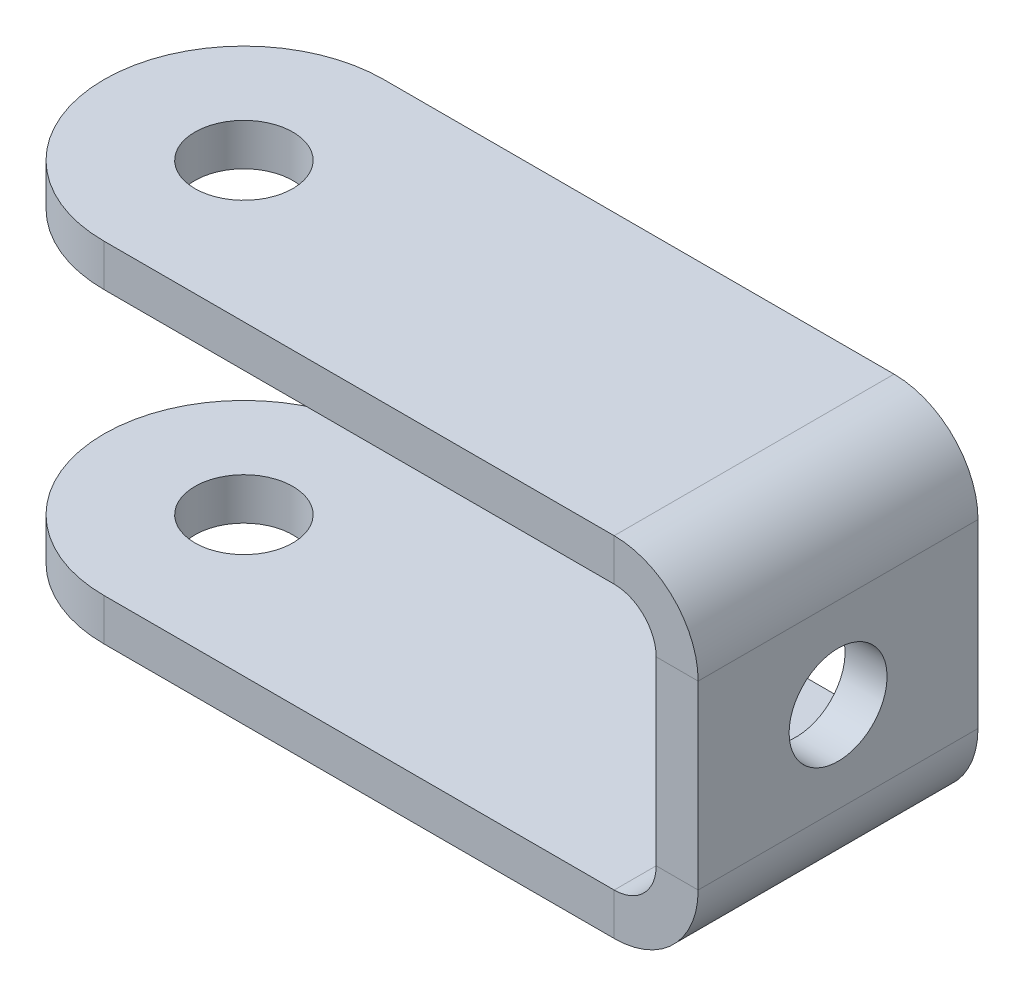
ISO-10303-21;
HEADER;
FILE_DESCRIPTION(('STEP AP214'),'2;1');
FILE_NAME('part.step','',(''),(''),'','','');
FILE_SCHEMA(('AUTOMOTIVE_DESIGN { 1 0 10303 214 1 1 1 1 }'));
ENDSEC;
DATA;
#1=APPLICATION_CONTEXT('core data for automotive mechanical design processes');
#2=APPLICATION_PROTOCOL_DEFINITION('international standard','automotive_design',2000,#1);
#3=PRODUCT_CONTEXT('',#1,'mechanical');
#4=PRODUCT('Part','Part','',(#3));
#5=PRODUCT_RELATED_PRODUCT_CATEGORY('part','',(#4));
#6=PRODUCT_DEFINITION_FORMATION('','',#4);
#7=PRODUCT_DEFINITION_CONTEXT('part definition',#1,'design');
#8=PRODUCT_DEFINITION('design','',#6,#7);
#9=PRODUCT_DEFINITION_SHAPE('','',#8);
#10=(LENGTH_UNIT() NAMED_UNIT(*) SI_UNIT(.MILLI.,.METRE.));
#11=(NAMED_UNIT(*) PLANE_ANGLE_UNIT() SI_UNIT($,.RADIAN.));
#12=(NAMED_UNIT(*) SI_UNIT($,.STERADIAN.) SOLID_ANGLE_UNIT());
#13=UNCERTAINTY_MEASURE_WITH_UNIT(LENGTH_MEASURE(1.E-05),#10,'distance_accuracy_value','');
#14=(GEOMETRIC_REPRESENTATION_CONTEXT(3) GLOBAL_UNCERTAINTY_ASSIGNED_CONTEXT((#13)) GLOBAL_UNIT_ASSIGNED_CONTEXT((#10,
#11,#12)) REPRESENTATION_CONTEXT('',''));
#15=CARTESIAN_POINT('',(0.,0.,0.));
#16=DIRECTION('',(0.,0.,1.));
#17=DIRECTION('',(1.,0.,0.));
#18=AXIS2_PLACEMENT_3D('',#15,#16,#17);
#19=CARTESIAN_POINT('',(19.7328541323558,-18.7671458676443,-5.));
#20=DIRECTION('',(-1.,0.,0.));
#21=DIRECTION('',(0.,0.,1.));
#22=AXIS2_PLACEMENT_3D('',#19,#20,#21);
#23=PLANE('',#22);
#24=CARTESIAN_POINT('',(19.7328541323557,6.23285413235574,-5.));
#25=DIRECTION('',(-1.,0.,0.));
#26=DIRECTION('',(0.,0.,1.));
#27=AXIS2_PLACEMENT_3D('',#24,#25,#26);
#28=CIRCLE('',#27,1.75);
#29=CARTESIAN_POINT('',(19.7328541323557,6.23285413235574,-3.25));
#30=VERTEX_POINT('',#29);
#31=EDGE_CURVE('E172',#30,#30,#28,.T.);
#32=ORIENTED_EDGE('',*,*,#31,.F.);
#33=EDGE_LOOP('',(#32));
#34=FACE_BOUND('',#33,.T.);
#35=DIRECTION('',(0.,-1.,0.));
#36=VECTOR('',#35,1.);
#37=CARTESIAN_POINT('',(19.7328541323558,-18.7671458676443,-10.));
#38=LINE('',#37,#36);
#39=CARTESIAN_POINT('',(19.7328541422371,9.46570826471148,-10.));
#40=VERTEX_POINT('',#39);
#41=CARTESIAN_POINT('',(19.7328541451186,3.00000000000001,-10.));
#42=VERTEX_POINT('',#41);
#43=EDGE_CURVE('E44',#40,#42,#38,.T.);
#44=ORIENTED_EDGE('',*,*,#43,.T.);
#45=DIRECTION('',(0.,0.,1.));
#46=VECTOR('',#45,1.);
#47=CARTESIAN_POINT('',(19.7328541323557,3.00000000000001,-5.));
#48=LINE('',#47,#46);
#49=CARTESIAN_POINT('',(19.7328541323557,3.00000000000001,0.));
#50=VERTEX_POINT('',#49);
#51=EDGE_CURVE('E142',#42,#50,#48,.T.);
#52=ORIENTED_EDGE('',*,*,#51,.T.);
#53=DIRECTION('',(0.,1.,0.));
#54=VECTOR('',#53,1.);
#55=CARTESIAN_POINT('',(19.7328541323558,-18.7671458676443,0.));
#56=LINE('',#55,#54);
#57=CARTESIAN_POINT('',(19.7328541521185,9.46570826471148,0.));
#58=VERTEX_POINT('',#57);
#59=EDGE_CURVE('E161',#50,#58,#56,.T.);
#60=ORIENTED_EDGE('',*,*,#59,.T.);
#61=DIRECTION('',(0.,0.,1.));
#62=VECTOR('',#61,1.);
#63=CARTESIAN_POINT('',(19.7328541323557,9.46570826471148,-5.));
#64=LINE('',#63,#62);
#65=EDGE_CURVE('E179',#40,#58,#64,.T.);
#66=ORIENTED_EDGE('',*,*,#65,.F.);
#67=EDGE_LOOP('',(#44,#52,#60,#66));
#68=FACE_BOUND('',#67,.T.);
#69=ADVANCED_FACE('F40',(#34,#68),#23,.T.);
#70=CARTESIAN_POINT('',(19.7328541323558,-18.7671458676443,-10.));
#71=DIRECTION('',(0.,0.,1.));
#72=DIRECTION('',(0.,1.,0.));
#73=AXIS2_PLACEMENT_3D('',#70,#71,#72);
#74=PLANE('',#73);
#75=DIRECTION('',(1.,0.,0.));
#76=VECTOR('',#75,1.);
#77=CARTESIAN_POINT('',(19.7328541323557,3.00000000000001,-10.));
#78=LINE('',#77,#76);
#79=CARTESIAN_POINT('',(21.2328541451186,3.00000000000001,-10.));
#80=VERTEX_POINT('',#79);
#81=EDGE_CURVE('E131',#42,#80,#78,.T.);
#82=ORIENTED_EDGE('',*,*,#81,.F.);
#83=ORIENTED_EDGE('',*,*,#43,.F.);
#84=DIRECTION('',(1.,0.,0.));
#85=VECTOR('',#84,1.);
#86=CARTESIAN_POINT('',(19.7328541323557,9.46570826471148,-10.));
#87=LINE('',#86,#85);
#88=CARTESIAN_POINT('',(21.2328541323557,9.46570826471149,-10.));
#89=VERTEX_POINT('',#88);
#90=EDGE_CURVE('E158',#40,#89,#87,.T.);
#91=ORIENTED_EDGE('',*,*,#90,.T.);
#92=DIRECTION('',(0.,-1.,0.));
#93=VECTOR('',#92,1.);
#94=CARTESIAN_POINT('',(21.2328541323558,-18.7671458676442,-10.));
#95=LINE('',#94,#93);
#96=EDGE_CURVE('E156',#89,#80,#95,.T.);
#97=ORIENTED_EDGE('',*,*,#96,.T.);
#98=EDGE_LOOP('',(#82,#83,#91,#97));
#99=FACE_BOUND('',#98,.T.);
#100=ADVANCED_FACE('F157',(#99),#74,.F.);
#101=CARTESIAN_POINT('',(19.7328541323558,-18.7671458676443,0.));
#102=DIRECTION('',(0.,0.,-1.));
#103=DIRECTION('',(0.,-1.,0.));
#104=AXIS2_PLACEMENT_3D('',#101,#102,#103);
#105=PLANE('',#104);
#106=DIRECTION('',(-1.,0.,0.));
#107=VECTOR('',#106,1.);
#108=CARTESIAN_POINT('',(19.7328541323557,3.00000000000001,0.));
#109=LINE('',#108,#107);
#110=CARTESIAN_POINT('',(21.2328541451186,3.00000000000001,0.));
#111=VERTEX_POINT('',#110);
#112=EDGE_CURVE('E12',#111,#50,#109,.T.);
#113=ORIENTED_EDGE('',*,*,#112,.F.);
#114=DIRECTION('',(0.,1.,0.));
#115=VECTOR('',#114,1.);
#116=CARTESIAN_POINT('',(21.2328541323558,-18.7671458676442,0.));
#117=LINE('',#116,#115);
#118=CARTESIAN_POINT('',(21.2328541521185,9.46570826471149,0.));
#119=VERTEX_POINT('',#118);
#120=EDGE_CURVE('E162',#111,#119,#117,.T.);
#121=ORIENTED_EDGE('',*,*,#120,.T.);
#122=DIRECTION('',(-1.,0.,0.));
#123=VECTOR('',#122,1.);
#124=CARTESIAN_POINT('',(19.7328541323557,9.46570826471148,0.));
#125=LINE('',#124,#123);
#126=EDGE_CURVE('E180',#119,#58,#125,.T.);
#127=ORIENTED_EDGE('',*,*,#126,.T.);
#128=ORIENTED_EDGE('',*,*,#59,.F.);
#129=EDGE_LOOP('',(#113,#121,#127,#128));
#130=FACE_BOUND('',#129,.T.);
#131=ADVANCED_FACE('F42',(#130),#105,.F.);
#132=CARTESIAN_POINT('',(21.2328541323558,-18.7671458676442,-5.));
#133=DIRECTION('',(-1.,0.,0.));
#134=DIRECTION('',(0.,0.,1.));
#135=AXIS2_PLACEMENT_3D('',#132,#133,#134);
#136=PLANE('',#135);
#137=DIRECTION('',(0.,0.,1.));
#138=VECTOR('',#137,1.);
#139=CARTESIAN_POINT('',(21.2328541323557,3.00000000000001,-5.));
#140=LINE('',#139,#138);
#141=EDGE_CURVE('E49',#80,#111,#140,.T.);
#142=ORIENTED_EDGE('',*,*,#141,.F.);
#143=ORIENTED_EDGE('',*,*,#96,.F.);
#144=DIRECTION('',(0.,0.,1.));
#145=VECTOR('',#144,1.);
#146=CARTESIAN_POINT('',(21.2328541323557,9.46570826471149,-5.));
#147=LINE('',#146,#145);
#148=EDGE_CURVE('E186',#89,#119,#147,.T.);
#149=ORIENTED_EDGE('',*,*,#148,.T.);
#150=ORIENTED_EDGE('',*,*,#120,.F.);
#151=EDGE_LOOP('',(#142,#143,#149,#150));
#152=FACE_BOUND('',#151,.T.);
#153=CARTESIAN_POINT('',(21.2328541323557,6.23285413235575,-5.));
#154=DIRECTION('',(-1.,0.,0.));
#155=DIRECTION('',(0.,0.,1.));
#156=AXIS2_PLACEMENT_3D('',#153,#154,#155);
#157=CIRCLE('',#156,1.75);
#158=CARTESIAN_POINT('',(21.2328541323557,6.23285413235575,-3.25));
#159=VERTEX_POINT('',#158);
#160=EDGE_CURVE('E212',#159,#159,#157,.T.);
#161=ORIENTED_EDGE('',*,*,#160,.T.);
#162=EDGE_LOOP('',(#161));
#163=FACE_BOUND('',#162,.T.);
#164=ADVANCED_FACE('F165',(#152,#163),#136,.F.);
#165=CARTESIAN_POINT('',(19.7328541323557,6.23285413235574,-5.));
#166=DIRECTION('',(1.,0.,0.));
#167=DIRECTION('',(0.,0.,-1.));
#168=AXIS2_PLACEMENT_3D('',#165,#166,#167);
#169=CYLINDRICAL_SURFACE('',#168,1.75);
#170=ORIENTED_EDGE('',*,*,#31,.T.);
#171=EDGE_LOOP('',(#170));
#172=FACE_BOUND('',#171,.T.);
#173=ORIENTED_EDGE('',*,*,#160,.F.);
#174=EDGE_LOOP('',(#173));
#175=FACE_BOUND('',#174,.T.);
#176=ADVANCED_FACE('F218',(#172,#175),#169,.F.);
#177=CARTESIAN_POINT('',(18.2328541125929,9.46570826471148,-10.));
#178=DIRECTION('',(0.,0.,1.));
#179=DIRECTION('',(0.,1.,0.));
#180=AXIS2_PLACEMENT_3D('',#177,#178,#179);
#181=PLANE('',#180);
#182=DIRECTION('',(0.,1.,0.));
#183=VECTOR('',#182,1.);
#184=CARTESIAN_POINT('',(18.2328541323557,10.9657082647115,-10.));
#185=LINE('',#184,#183);
#186=CARTESIAN_POINT('',(18.2328541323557,10.9657082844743,-10.));
#187=VERTEX_POINT('',#186);
#188=CARTESIAN_POINT('',(18.2328541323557,12.4657082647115,-10.));
#189=VERTEX_POINT('',#188);
#190=EDGE_CURVE('E536',#187,#189,#185,.T.);
#191=ORIENTED_EDGE('',*,*,#190,.T.);
#192=CARTESIAN_POINT('',(18.2328541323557,9.46570826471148,-10.));
#193=DIRECTION('',(0.,0.,-1.));
#194=DIRECTION('',(0.,-1.,0.));
#195=AXIS2_PLACEMENT_3D('',#192,#193,#194);
#196=CIRCLE('',#195,3.0000000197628);
#197=EDGE_CURVE('E57',#189,#89,#196,.T.);
#198=ORIENTED_EDGE('',*,*,#197,.T.);
#199=ORIENTED_EDGE('',*,*,#90,.F.);
#200=CARTESIAN_POINT('',(18.2328541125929,9.46570826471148,-10.));
#201=DIRECTION('',(0.,0.,-1.));
#202=DIRECTION('',(0.,-1.,0.));
#203=AXIS2_PLACEMENT_3D('',#200,#201,#202);
#204=CIRCLE('',#203,1.5000000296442);
#205=EDGE_CURVE('E205',#187,#40,#204,.T.);
#206=ORIENTED_EDGE('',*,*,#205,.F.);
#207=EDGE_LOOP('',(#191,#198,#199,#206));
#208=FACE_BOUND('',#207,.T.);
#209=ADVANCED_FACE('F234',(#208),#181,.F.);
#210=CARTESIAN_POINT('',(18.2328541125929,9.46570826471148,0.));
#211=DIRECTION('',(0.,0.,-1.));
#212=DIRECTION('',(0.,-1.,0.));
#213=AXIS2_PLACEMENT_3D('',#210,#211,#212);
#214=PLANE('',#213);
#215=CARTESIAN_POINT('',(18.2328541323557,9.46570826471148,0.));
#216=DIRECTION('',(0.,0.,-1.));
#217=DIRECTION('',(0.,-1.,0.));
#218=AXIS2_PLACEMENT_3D('',#215,#216,#217);
#219=CIRCLE('',#218,3.0000000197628);
#220=CARTESIAN_POINT('',(18.2328541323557,12.4657082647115,0.));
#221=VERTEX_POINT('',#220);
#222=EDGE_CURVE('E198',#119,#221,#219,.F.);
#223=ORIENTED_EDGE('',*,*,#222,.T.);
#224=DIRECTION('',(0.,-1.,0.));
#225=VECTOR('',#224,1.);
#226=CARTESIAN_POINT('',(18.2328541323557,10.9657082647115,0.));
#227=LINE('',#226,#225);
#228=CARTESIAN_POINT('',(18.2328541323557,10.9657082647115,0.));
#229=VERTEX_POINT('',#228);
#230=EDGE_CURVE('E508',#221,#229,#227,.T.);
#231=ORIENTED_EDGE('',*,*,#230,.T.);
#232=CARTESIAN_POINT('',(18.2328541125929,9.46570826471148,0.));
#233=DIRECTION('',(0.,0.,1.));
#234=DIRECTION('',(0.,1.,0.));
#235=AXIS2_PLACEMENT_3D('',#232,#233,#234);
#236=CIRCLE('',#235,1.5000000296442);
#237=EDGE_CURVE('E199',#58,#229,#236,.T.);
#238=ORIENTED_EDGE('',*,*,#237,.F.);
#239=ORIENTED_EDGE('',*,*,#126,.F.);
#240=EDGE_LOOP('',(#223,#231,#238,#239));
#241=FACE_BOUND('',#240,.T.);
#242=ADVANCED_FACE('F196',(#241),#214,.F.);
#243=CARTESIAN_POINT('',(18.2328541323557,9.46570826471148,5.71173272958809));
#244=DIRECTION('',(0.,0.,-1.));
#245=DIRECTION('',(0.,-1.,0.));
#246=AXIS2_PLACEMENT_3D('',#243,#244,#245);
#247=CYLINDRICAL_SURFACE('',#246,1.5000000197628);
#248=ORIENTED_EDGE('',*,*,#65,.T.);
#249=ORIENTED_EDGE('',*,*,#237,.T.);
#250=DIRECTION('',(0.,0.,1.));
#251=VECTOR('',#250,1.);
#252=CARTESIAN_POINT('',(18.2328541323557,10.9657082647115,-5.));
#253=LINE('',#252,#251);
#254=EDGE_CURVE('E528',#187,#229,#253,.T.);
#255=ORIENTED_EDGE('',*,*,#254,.F.);
#256=ORIENTED_EDGE('',*,*,#205,.T.);
#257=EDGE_LOOP('',(#248,#249,#255,#256));
#258=FACE_BOUND('',#257,.T.);
#259=ADVANCED_FACE('F274',(#258),#247,.F.);
#260=CARTESIAN_POINT('',(18.2328541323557,9.46570826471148,5.71173272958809));
#261=DIRECTION('',(0.,0.,-1.));
#262=DIRECTION('',(0.,-1.,0.));
#263=AXIS2_PLACEMENT_3D('',#260,#261,#262);
#264=CYLINDRICAL_SURFACE('',#263,3.0000000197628);
#265=ORIENTED_EDGE('',*,*,#148,.F.);
#266=ORIENTED_EDGE('',*,*,#197,.F.);
#267=DIRECTION('',(0.,0.,1.));
#268=VECTOR('',#267,1.);
#269=CARTESIAN_POINT('',(18.2328541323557,12.4657082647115,-5.));
#270=LINE('',#269,#268);
#271=EDGE_CURVE('E204',#189,#221,#270,.T.);
#272=ORIENTED_EDGE('',*,*,#271,.T.);
#273=ORIENTED_EDGE('',*,*,#222,.F.);
#274=EDGE_LOOP('',(#265,#266,#272,#273));
#275=FACE_BOUND('',#274,.T.);
#276=ADVANCED_FACE('F202',(#275),#264,.T.);
#277=CARTESIAN_POINT('',(0.,10.9657082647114,-5.));
#278=DIRECTION('',(0.,1.,0.));
#279=DIRECTION('',(0.,0.,-1.));
#280=AXIS2_PLACEMENT_3D('',#277,#278,#279);
#281=CYLINDRICAL_SURFACE('',#280,5.);
#282=CARTESIAN_POINT('',(0.,12.4657082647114,-5.));
#283=DIRECTION('',(0.,-1.,0.));
#284=DIRECTION('',(0.,0.,1.));
#285=AXIS2_PLACEMENT_3D('',#282,#283,#284);
#286=CIRCLE('',#285,5.);
#287=CARTESIAN_POINT('',(0.,12.4657082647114,0.));
#288=VERTEX_POINT('',#287);
#289=CARTESIAN_POINT('',(0.,12.4657082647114,-10.));
#290=VERTEX_POINT('',#289);
#291=EDGE_CURVE('E500',#288,#290,#286,.T.);
#292=ORIENTED_EDGE('',*,*,#291,.T.);
#293=DIRECTION('',(0.,1.,0.));
#294=VECTOR('',#293,1.);
#295=CARTESIAN_POINT('',(0.,10.9657082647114,-10.));
#296=LINE('',#295,#294);
#297=CARTESIAN_POINT('',(0.,10.9657082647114,-10.));
#298=VERTEX_POINT('',#297);
#299=EDGE_CURVE('E503',#298,#290,#296,.T.);
#300=ORIENTED_EDGE('',*,*,#299,.F.);
#301=CARTESIAN_POINT('',(0.,10.9657082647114,-5.));
#302=DIRECTION('',(0.,-1.,0.));
#303=DIRECTION('',(0.,0.,1.));
#304=AXIS2_PLACEMENT_3D('',#301,#302,#303);
#305=CIRCLE('',#304,5.);
#306=CARTESIAN_POINT('',(0.,10.9657082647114,0.));
#307=VERTEX_POINT('',#306);
#308=EDGE_CURVE('E524',#307,#298,#305,.T.);
#309=ORIENTED_EDGE('',*,*,#308,.F.);
#310=DIRECTION('',(0.,1.,0.));
#311=VECTOR('',#310,1.);
#312=CARTESIAN_POINT('',(0.,10.9657082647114,0.));
#313=LINE('',#312,#311);
#314=EDGE_CURVE('E506',#307,#288,#313,.T.);
#315=ORIENTED_EDGE('',*,*,#314,.T.);
#316=EDGE_LOOP('',(#292,#300,#309,#315));
#317=FACE_BOUND('',#316,.T.);
#318=ADVANCED_FACE('F300',(#317),#281,.T.);
#319=CARTESIAN_POINT('',(0.,10.9657082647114,-5.));
#320=DIRECTION('',(0.,1.,0.));
#321=DIRECTION('',(0.,0.,-1.));
#322=AXIS2_PLACEMENT_3D('',#319,#320,#321);
#323=CYLINDRICAL_SURFACE('',#322,1.75);
#324=CARTESIAN_POINT('',(0.,10.9657082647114,-5.));
#325=DIRECTION('',(0.,-1.,0.));
#326=DIRECTION('',(0.,0.,1.));
#327=AXIS2_PLACEMENT_3D('',#324,#325,#326);
#328=CIRCLE('',#327,1.75);
#329=CARTESIAN_POINT('',(0.,10.9657082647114,-3.25));
#330=VERTEX_POINT('',#329);
#331=EDGE_CURVE('E531',#330,#330,#328,.T.);
#332=ORIENTED_EDGE('',*,*,#331,.T.);
#333=EDGE_LOOP('',(#332));
#334=FACE_BOUND('',#333,.T.);
#335=CARTESIAN_POINT('',(0.,12.4657082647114,-5.));
#336=DIRECTION('',(0.,-1.,0.));
#337=DIRECTION('',(0.,0.,1.));
#338=AXIS2_PLACEMENT_3D('',#335,#336,#337);
#339=CIRCLE('',#338,1.75);
#340=CARTESIAN_POINT('',(0.,12.4657082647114,-3.25));
#341=VERTEX_POINT('',#340);
#342=EDGE_CURVE('E512',#341,#341,#339,.T.);
#343=ORIENTED_EDGE('',*,*,#342,.F.);
#344=EDGE_LOOP('',(#343));
#345=FACE_BOUND('',#344,.T.);
#346=ADVANCED_FACE('F314',(#334,#345),#323,.F.);
#347=CARTESIAN_POINT('',(50.,10.9657082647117,-5.));
#348=DIRECTION('',(0.,-1.,0.));
#349=DIRECTION('',(0.,0.,1.));
#350=AXIS2_PLACEMENT_3D('',#347,#348,#349);
#351=PLANE('',#350);
#352=ORIENTED_EDGE('',*,*,#331,.F.);
#353=EDGE_LOOP('',(#352));
#354=FACE_BOUND('',#353,.T.);
#355=DIRECTION('',(1.,0.,0.));
#356=VECTOR('',#355,1.);
#357=CARTESIAN_POINT('',(50.,10.9657082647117,-10.));
#358=LINE('',#357,#356);
#359=EDGE_CURVE('E511',#298,#187,#358,.T.);
#360=ORIENTED_EDGE('',*,*,#359,.T.);
#361=ORIENTED_EDGE('',*,*,#254,.T.);
#362=DIRECTION('',(-1.,0.,0.));
#363=VECTOR('',#362,1.);
#364=CARTESIAN_POINT('',(50.,10.9657082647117,0.));
#365=LINE('',#364,#363);
#366=EDGE_CURVE('E526',#229,#307,#365,.T.);
#367=ORIENTED_EDGE('',*,*,#366,.T.);
#368=ORIENTED_EDGE('',*,*,#308,.T.);
#369=EDGE_LOOP('',(#360,#361,#367,#368));
#370=FACE_BOUND('',#369,.T.);
#371=ADVANCED_FACE('F306',(#354,#370),#351,.T.);
#372=CARTESIAN_POINT('',(50.,10.9657082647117,0.));
#373=DIRECTION('',(0.,0.,-1.));
#374=DIRECTION('',(1.,0.,0.));
#375=AXIS2_PLACEMENT_3D('',#372,#373,#374);
#376=PLANE('',#375);
#377=ORIENTED_EDGE('',*,*,#230,.F.);
#378=DIRECTION('',(-1.,0.,0.));
#379=VECTOR('',#378,1.);
#380=CARTESIAN_POINT('',(50.,12.4657082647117,0.));
#381=LINE('',#380,#379);
#382=EDGE_CURVE('E522',#221,#288,#381,.T.);
#383=ORIENTED_EDGE('',*,*,#382,.T.);
#384=ORIENTED_EDGE('',*,*,#314,.F.);
#385=ORIENTED_EDGE('',*,*,#366,.F.);
#386=EDGE_LOOP('',(#377,#383,#384,#385));
#387=FACE_BOUND('',#386,.T.);
#388=ADVANCED_FACE('F313',(#387),#376,.F.);
#389=CARTESIAN_POINT('',(50.,12.4657082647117,-5.));
#390=DIRECTION('',(0.,-1.,0.));
#391=DIRECTION('',(0.,0.,1.));
#392=AXIS2_PLACEMENT_3D('',#389,#390,#391);
#393=PLANE('',#392);
#394=ORIENTED_EDGE('',*,*,#271,.F.);
#395=DIRECTION('',(1.,0.,0.));
#396=VECTOR('',#395,1.);
#397=CARTESIAN_POINT('',(50.,12.4657082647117,-10.));
#398=LINE('',#397,#396);
#399=EDGE_CURVE('E208',#290,#189,#398,.T.);
#400=ORIENTED_EDGE('',*,*,#399,.F.);
#401=ORIENTED_EDGE('',*,*,#291,.F.);
#402=ORIENTED_EDGE('',*,*,#382,.F.);
#403=EDGE_LOOP('',(#394,#400,#401,#402));
#404=FACE_BOUND('',#403,.T.);
#405=ORIENTED_EDGE('',*,*,#342,.T.);
#406=EDGE_LOOP('',(#405));
#407=FACE_BOUND('',#406,.T.);
#408=ADVANCED_FACE('F323',(#404,#407),#393,.F.);
#409=CARTESIAN_POINT('',(50.,10.9657082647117,-10.));
#410=DIRECTION('',(0.,0.,1.));
#411=DIRECTION('',(-1.,0.,0.));
#412=AXIS2_PLACEMENT_3D('',#409,#410,#411);
#413=PLANE('',#412);
#414=ORIENTED_EDGE('',*,*,#190,.F.);
#415=ORIENTED_EDGE('',*,*,#359,.F.);
#416=ORIENTED_EDGE('',*,*,#299,.T.);
#417=ORIENTED_EDGE('',*,*,#399,.T.);
#418=EDGE_LOOP('',(#414,#415,#416,#417));
#419=FACE_BOUND('',#418,.T.);
#420=ADVANCED_FACE('F330',(#419),#413,.F.);
#421=CARTESIAN_POINT('',(0.,1.5,-5.));
#422=DIRECTION('',(0.,-1.,0.));
#423=DIRECTION('',(0.,0.,-1.));
#424=AXIS2_PLACEMENT_3D('',#421,#422,#423);
#425=CYLINDRICAL_SURFACE('',#424,1.75);
#426=CARTESIAN_POINT('',(0.,1.5,-5.));
#427=DIRECTION('',(0.,1.,0.));
#428=DIRECTION('',(0.,0.,1.));
#429=AXIS2_PLACEMENT_3D('',#426,#427,#428);
#430=CIRCLE('',#429,1.75);
#431=CARTESIAN_POINT('',(0.,1.5,-3.25));
#432=VERTEX_POINT('',#431);
#433=EDGE_CURVE('E573',#432,#432,#430,.T.);
#434=ORIENTED_EDGE('',*,*,#433,.T.);
#435=EDGE_LOOP('',(#434));
#436=FACE_BOUND('',#435,.T.);
#437=CARTESIAN_POINT('',(0.,0.,-5.));
#438=DIRECTION('',(0.,1.,0.));
#439=DIRECTION('',(0.,0.,1.));
#440=AXIS2_PLACEMENT_3D('',#437,#438,#439);
#441=CIRCLE('',#440,1.75);
#442=CARTESIAN_POINT('',(0.,0.,-3.25));
#443=VERTEX_POINT('',#442);
#444=EDGE_CURVE('E553',#443,#443,#441,.T.);
#445=ORIENTED_EDGE('',*,*,#444,.F.);
#446=EDGE_LOOP('',(#445));
#447=FACE_BOUND('',#446,.T.);
#448=ADVANCED_FACE('F417',(#436,#447),#425,.F.);
#449=CARTESIAN_POINT('',(0.,1.5,-5.));
#450=DIRECTION('',(0.,-1.,0.));
#451=DIRECTION('',(0.,0.,-1.));
#452=AXIS2_PLACEMENT_3D('',#449,#450,#451);
#453=CYLINDRICAL_SURFACE('',#452,5.);
#454=CARTESIAN_POINT('',(0.,0.,-5.));
#455=DIRECTION('',(0.,1.,0.));
#456=DIRECTION('',(0.,0.,1.));
#457=AXIS2_PLACEMENT_3D('',#454,#455,#456);
#458=CIRCLE('',#457,5.);
#459=CARTESIAN_POINT('',(0.,0.,-10.));
#460=VERTEX_POINT('',#459);
#461=CARTESIAN_POINT('',(0.,0.,0.));
#462=VERTEX_POINT('',#461);
#463=EDGE_CURVE('E572',#460,#462,#458,.T.);
#464=ORIENTED_EDGE('',*,*,#463,.T.);
#465=DIRECTION('',(0.,-1.,0.));
#466=VECTOR('',#465,1.);
#467=CARTESIAN_POINT('',(0.,1.5,0.));
#468=LINE('',#467,#466);
#469=CARTESIAN_POINT('',(0.,1.5,0.));
#470=VERTEX_POINT('',#469);
#471=EDGE_CURVE('E537',#470,#462,#468,.T.);
#472=ORIENTED_EDGE('',*,*,#471,.F.);
#473=CARTESIAN_POINT('',(0.,1.5,-5.));
#474=DIRECTION('',(0.,1.,0.));
#475=DIRECTION('',(0.,0.,1.));
#476=AXIS2_PLACEMENT_3D('',#473,#474,#475);
#477=CIRCLE('',#476,5.);
#478=CARTESIAN_POINT('',(0.,1.5,-10.));
#479=VERTEX_POINT('',#478);
#480=EDGE_CURVE('E564',#479,#470,#477,.T.);
#481=ORIENTED_EDGE('',*,*,#480,.F.);
#482=DIRECTION('',(0.,-1.,0.));
#483=VECTOR('',#482,1.);
#484=CARTESIAN_POINT('',(0.,1.5,-10.));
#485=LINE('',#484,#483);
#486=EDGE_CURVE('E569',#479,#460,#485,.T.);
#487=ORIENTED_EDGE('',*,*,#486,.T.);
#488=EDGE_LOOP('',(#464,#472,#481,#487));
#489=FACE_BOUND('',#488,.T.);
#490=ADVANCED_FACE('F409',(#489),#453,.T.);
#491=CARTESIAN_POINT('',(0.,1.5,-5.));
#492=DIRECTION('',(0.,1.,0.));
#493=DIRECTION('',(0.,0.,1.));
#494=AXIS2_PLACEMENT_3D('',#491,#492,#493);
#495=PLANE('',#494);
#496=DIRECTION('',(0.,0.,1.));
#497=VECTOR('',#496,1.);
#498=CARTESIAN_POINT('',(18.2328541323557,1.5,-5.));
#499=LINE('',#498,#497);
#500=CARTESIAN_POINT('',(18.2328541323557,1.49999999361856,-10.));
#501=VERTEX_POINT('',#500);
#502=CARTESIAN_POINT('',(18.2328541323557,1.49999998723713,0.));
#503=VERTEX_POINT('',#502);
#504=EDGE_CURVE('E517',#501,#503,#499,.T.);
#505=ORIENTED_EDGE('',*,*,#504,.F.);
#506=DIRECTION('',(-1.,0.,0.));
#507=VECTOR('',#506,1.);
#508=CARTESIAN_POINT('',(0.,1.5,-10.));
#509=LINE('',#508,#507);
#510=EDGE_CURVE('E567',#501,#479,#509,.T.);
#511=ORIENTED_EDGE('',*,*,#510,.T.);
#512=ORIENTED_EDGE('',*,*,#480,.T.);
#513=DIRECTION('',(1.,0.,0.));
#514=VECTOR('',#513,1.);
#515=CARTESIAN_POINT('',(0.,1.5,0.));
#516=LINE('',#515,#514);
#517=EDGE_CURVE('E561',#470,#503,#516,.T.);
#518=ORIENTED_EDGE('',*,*,#517,.T.);
#519=EDGE_LOOP('',(#505,#511,#512,#518));
#520=FACE_BOUND('',#519,.T.);
#521=ORIENTED_EDGE('',*,*,#433,.F.);
#522=EDGE_LOOP('',(#521));
#523=FACE_BOUND('',#522,.T.);
#524=ADVANCED_FACE('F402',(#520,#523),#495,.T.);
#525=CARTESIAN_POINT('',(0.,1.5,-10.));
#526=DIRECTION('',(0.,0.,1.));
#527=DIRECTION('',(1.,0.,0.));
#528=AXIS2_PLACEMENT_3D('',#525,#526,#527);
#529=PLANE('',#528);
#530=ORIENTED_EDGE('',*,*,#510,.F.);
#531=DIRECTION('',(0.,-1.,0.));
#532=VECTOR('',#531,1.);
#533=CARTESIAN_POINT('',(18.2328541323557,1.5,-10.));
#534=LINE('',#533,#532);
#535=CARTESIAN_POINT('',(18.2328541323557,0.,-10.));
#536=VERTEX_POINT('',#535);
#537=EDGE_CURVE('E558',#501,#536,#534,.T.);
#538=ORIENTED_EDGE('',*,*,#537,.T.);
#539=DIRECTION('',(-1.,0.,0.));
#540=VECTOR('',#539,1.);
#541=CARTESIAN_POINT('',(0.,0.,-10.));
#542=LINE('',#541,#540);
#543=EDGE_CURVE('E556',#536,#460,#542,.T.);
#544=ORIENTED_EDGE('',*,*,#543,.T.);
#545=ORIENTED_EDGE('',*,*,#486,.F.);
#546=EDGE_LOOP('',(#530,#538,#544,#545));
#547=FACE_BOUND('',#546,.T.);
#548=ADVANCED_FACE('F344',(#547),#529,.F.);
#549=CARTESIAN_POINT('',(0.,0.,-5.));
#550=DIRECTION('',(0.,1.,0.));
#551=DIRECTION('',(0.,0.,1.));
#552=AXIS2_PLACEMENT_3D('',#549,#550,#551);
#553=PLANE('',#552);
#554=ORIENTED_EDGE('',*,*,#444,.T.);
#555=EDGE_LOOP('',(#554));
#556=FACE_BOUND('',#555,.T.);
#557=ORIENTED_EDGE('',*,*,#543,.F.);
#558=DIRECTION('',(0.,0.,1.));
#559=VECTOR('',#558,1.);
#560=CARTESIAN_POINT('',(18.2328541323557,0.,-5.));
#561=LINE('',#560,#559);
#562=CARTESIAN_POINT('',(18.2328541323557,-1.27628710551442E-08,0.));
#563=VERTEX_POINT('',#562);
#564=EDGE_CURVE('E150',#536,#563,#561,.T.);
#565=ORIENTED_EDGE('',*,*,#564,.T.);
#566=DIRECTION('',(1.,0.,0.));
#567=VECTOR('',#566,1.);
#568=CARTESIAN_POINT('',(0.,0.,0.));
#569=LINE('',#568,#567);
#570=EDGE_CURVE('E546',#462,#563,#569,.T.);
#571=ORIENTED_EDGE('',*,*,#570,.F.);
#572=ORIENTED_EDGE('',*,*,#463,.F.);
#573=EDGE_LOOP('',(#557,#565,#571,#572));
#574=FACE_BOUND('',#573,.T.);
#575=ADVANCED_FACE('F337',(#556,#574),#553,.F.);
#576=CARTESIAN_POINT('',(0.,1.5,0.));
#577=DIRECTION('',(0.,0.,-1.));
#578=DIRECTION('',(-1.,0.,0.));
#579=AXIS2_PLACEMENT_3D('',#576,#577,#578);
#580=PLANE('',#579);
#581=ORIENTED_EDGE('',*,*,#570,.T.);
#582=DIRECTION('',(0.,1.,0.));
#583=VECTOR('',#582,1.);
#584=CARTESIAN_POINT('',(18.2328541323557,1.5,0.));
#585=LINE('',#584,#583);
#586=EDGE_CURVE('E540',#563,#503,#585,.T.);
#587=ORIENTED_EDGE('',*,*,#586,.T.);
#588=ORIENTED_EDGE('',*,*,#517,.F.);
#589=ORIENTED_EDGE('',*,*,#471,.T.);
#590=EDGE_LOOP('',(#581,#587,#588,#589));
#591=FACE_BOUND('',#590,.T.);
#592=ADVANCED_FACE('F254',(#591),#580,.F.);
#593=CARTESIAN_POINT('',(18.2328541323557,3.00000001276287,-10.));
#594=DIRECTION('',(0.,0.,1.));
#595=DIRECTION('',(1.,0.,0.));
#596=AXIS2_PLACEMENT_3D('',#593,#594,#595);
#597=PLANE('',#596);
#598=ORIENTED_EDGE('',*,*,#81,.T.);
#599=CARTESIAN_POINT('',(18.2328541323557,3.,-10.));
#600=DIRECTION('',(0.,0.,-1.));
#601=DIRECTION('',(-1.,0.,0.));
#602=AXIS2_PLACEMENT_3D('',#599,#600,#601);
#603=CIRCLE('',#602,3.00000001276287);
#604=EDGE_CURVE('E134',#80,#536,#603,.T.);
#605=ORIENTED_EDGE('',*,*,#604,.T.);
#606=ORIENTED_EDGE('',*,*,#537,.F.);
#607=CARTESIAN_POINT('',(18.2328541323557,3.00000001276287,-10.));
#608=DIRECTION('',(0.,0.,-1.));
#609=DIRECTION('',(-1.,0.,0.));
#610=AXIS2_PLACEMENT_3D('',#607,#608,#609);
#611=CIRCLE('',#610,1.50000001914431);
#612=EDGE_CURVE('E137',#42,#501,#611,.T.);
#613=ORIENTED_EDGE('',*,*,#612,.F.);
#614=EDGE_LOOP('',(#598,#605,#606,#613));
#615=FACE_BOUND('',#614,.T.);
#616=ADVANCED_FACE('F133',(#615),#597,.F.);
#617=CARTESIAN_POINT('',(18.2328541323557,3.00000001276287,0.));
#618=DIRECTION('',(0.,0.,-1.));
#619=DIRECTION('',(-1.,0.,0.));
#620=AXIS2_PLACEMENT_3D('',#617,#618,#619);
#621=PLANE('',#620);
#622=CARTESIAN_POINT('',(18.2328541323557,3.,0.));
#623=DIRECTION('',(0.,0.,-1.));
#624=DIRECTION('',(-1.,0.,0.));
#625=AXIS2_PLACEMENT_3D('',#622,#623,#624);
#626=CIRCLE('',#625,3.00000001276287);
#627=EDGE_CURVE('E152',#563,#111,#626,.F.);
#628=ORIENTED_EDGE('',*,*,#627,.T.);
#629=ORIENTED_EDGE('',*,*,#112,.T.);
#630=CARTESIAN_POINT('',(18.2328541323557,3.00000001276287,0.));
#631=DIRECTION('',(0.,0.,1.));
#632=DIRECTION('',(1.,0.,0.));
#633=AXIS2_PLACEMENT_3D('',#630,#631,#632);
#634=CIRCLE('',#633,1.50000001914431);
#635=EDGE_CURVE('E65',#503,#50,#634,.T.);
#636=ORIENTED_EDGE('',*,*,#635,.F.);
#637=ORIENTED_EDGE('',*,*,#586,.F.);
#638=EDGE_LOOP('',(#628,#629,#636,#637));
#639=FACE_BOUND('',#638,.T.);
#640=ADVANCED_FACE('F357',(#639),#621,.F.);
#641=CARTESIAN_POINT('',(18.2328541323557,3.,5.71173272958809));
#642=DIRECTION('',(0.,0.,-1.));
#643=DIRECTION('',(-1.,0.,0.));
#644=AXIS2_PLACEMENT_3D('',#641,#642,#643);
#645=CYLINDRICAL_SURFACE('',#644,1.50000001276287);
#646=ORIENTED_EDGE('',*,*,#504,.T.);
#647=ORIENTED_EDGE('',*,*,#635,.T.);
#648=ORIENTED_EDGE('',*,*,#51,.F.);
#649=ORIENTED_EDGE('',*,*,#612,.T.);
#650=EDGE_LOOP('',(#646,#647,#648,#649));
#651=FACE_BOUND('',#650,.T.);
#652=ADVANCED_FACE('F359',(#651),#645,.F.);
#653=CARTESIAN_POINT('',(18.2328541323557,3.,5.71173272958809));
#654=DIRECTION('',(0.,0.,-1.));
#655=DIRECTION('',(-1.,0.,0.));
#656=AXIS2_PLACEMENT_3D('',#653,#654,#655);
#657=CYLINDRICAL_SURFACE('',#656,3.00000001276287);
#658=ORIENTED_EDGE('',*,*,#564,.F.);
#659=ORIENTED_EDGE('',*,*,#604,.F.);
#660=ORIENTED_EDGE('',*,*,#141,.T.);
#661=ORIENTED_EDGE('',*,*,#627,.F.);
#662=EDGE_LOOP('',(#658,#659,#660,#661));
#663=FACE_BOUND('',#662,.T.);
#664=ADVANCED_FACE('F145',(#663),#657,.T.);
#665=CLOSED_SHELL('',(#69,#100,#131,#164,#176,#209,#242,#259,#276,#318,#346,#371,#388,#408,#420,
#448,#490,#524,#548,#575,#592,#616,#640,#652,#664));
#666=MANIFOLD_SOLID_BREP('B2',#665);
#667=ADVANCED_BREP_SHAPE_REPRESENTATION('',(#18,#666),#14);
#668=SHAPE_DEFINITION_REPRESENTATION(#9,#667);
ENDSEC;
END-ISO-10303-21;
